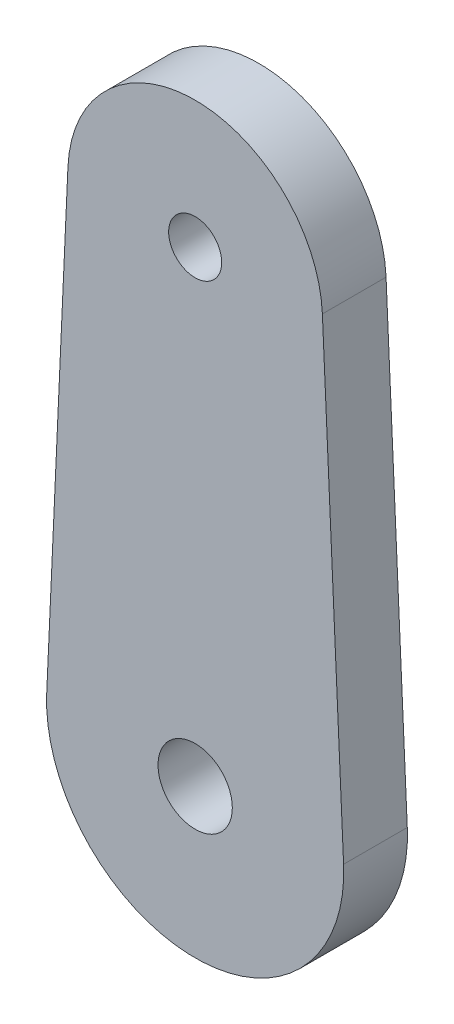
from build123d import *

# Parameters (mm, degrees)
SKETCH1_R         = 1.75
EXTRUDE1_DEPTH    = 3
M3_TAPPED_HOLE1_D = 2.5


with BuildPart() as part:
    # Sketch1 → Extrude1 (new body)
    with BuildSketch(Plane.XY):
        with BuildLine():
            Line((-5.993798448, 22.272727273), (-6.992764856, 0.318181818))
            ThreePointArc((-6.992764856, 0.318181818), (0, -7), (6.992764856, 0.318181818))
            Line((6.992764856, 0.318181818), (5.993798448, 22.272727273))
            ThreePointArc((5.993798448, 22.272727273), (0, 28), (-5.993798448, 22.272727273))
        make_face()
        Circle(SKETCH1_R, mode=Mode.SUBTRACT)
    extrude(amount=EXTRUDE1_DEPTH)

    # M3 Tapped Hole1 (through all)
    with Locations(Plane(origin=(0, 22, 3), x_dir=(1, 0, 0), z_dir=(0, 0, 1))):
        with Locations((0, 0)):
            Hole(M3_TAPPED_HOLE1_D / 2)


solid = part.part
